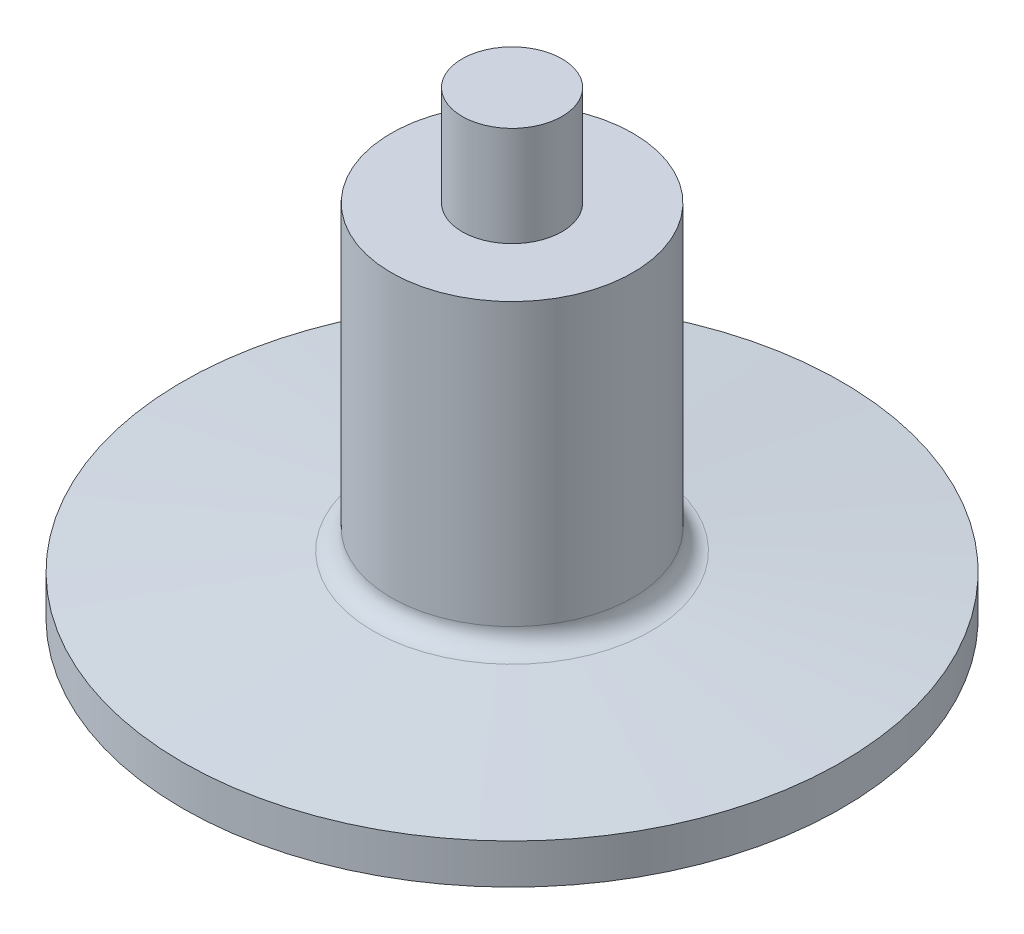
ISO-10303-21;
HEADER;
FILE_DESCRIPTION(('STEP AP214'),'2;1');
FILE_NAME('part.step','',(''),(''),'','','');
FILE_SCHEMA(('AUTOMOTIVE_DESIGN { 1 0 10303 214 1 1 1 1 }'));
ENDSEC;
DATA;
#1=APPLICATION_CONTEXT('core data for automotive mechanical design processes');
#2=APPLICATION_PROTOCOL_DEFINITION('international standard','automotive_design',2000,#1);
#3=PRODUCT_CONTEXT('',#1,'mechanical');
#4=PRODUCT('Part','Part','',(#3));
#5=PRODUCT_RELATED_PRODUCT_CATEGORY('part','',(#4));
#6=PRODUCT_DEFINITION_FORMATION('','',#4);
#7=PRODUCT_DEFINITION_CONTEXT('part definition',#1,'design');
#8=PRODUCT_DEFINITION('design','',#6,#7);
#9=PRODUCT_DEFINITION_SHAPE('','',#8);
#10=(LENGTH_UNIT() NAMED_UNIT(*) SI_UNIT(.MILLI.,.METRE.));
#11=(NAMED_UNIT(*) PLANE_ANGLE_UNIT() SI_UNIT($,.RADIAN.));
#12=(NAMED_UNIT(*) SI_UNIT($,.STERADIAN.) SOLID_ANGLE_UNIT());
#13=UNCERTAINTY_MEASURE_WITH_UNIT(LENGTH_MEASURE(1.E-05),#10,'distance_accuracy_value','');
#14=(GEOMETRIC_REPRESENTATION_CONTEXT(3) GLOBAL_UNCERTAINTY_ASSIGNED_CONTEXT((#13)) GLOBAL_UNIT_ASSIGNED_CONTEXT((#10,
#11,#12)) REPRESENTATION_CONTEXT('',''));
#15=CARTESIAN_POINT('',(0.,0.,0.));
#16=DIRECTION('',(0.,0.,1.));
#17=DIRECTION('',(1.,0.,0.));
#18=AXIS2_PLACEMENT_3D('',#15,#16,#17);
#19=CARTESIAN_POINT('',(0.,180.,0.));
#20=DIRECTION('',(0.,1.,0.));
#21=DIRECTION('',(0.,0.,1.));
#22=AXIS2_PLACEMENT_3D('',#19,#20,#21);
#23=PLANE('',#22);
#24=CARTESIAN_POINT('',(0.,180.,0.));
#25=DIRECTION('',(0.,1.,0.));
#26=DIRECTION('',(0.,0.,1.));
#27=AXIS2_PLACEMENT_3D('',#24,#25,#26);
#28=CIRCLE('',#27,60.5);
#29=CARTESIAN_POINT('',(0.,180.,60.5));
#30=VERTEX_POINT('',#29);
#31=EDGE_CURVE('E46',#30,#30,#28,.T.);
#32=ORIENTED_EDGE('',*,*,#31,.T.);
#33=EDGE_LOOP('',(#32));
#34=FACE_BOUND('',#33,.T.);
#35=CARTESIAN_POINT('',(0.,180.,0.));
#36=DIRECTION('',(0.,1.,0.));
#37=DIRECTION('',(0.,0.,1.));
#38=AXIS2_PLACEMENT_3D('',#35,#36,#37);
#39=CIRCLE('',#38,25.);
#40=CARTESIAN_POINT('',(0.,180.,25.));
#41=VERTEX_POINT('',#40);
#42=EDGE_CURVE('E52',#41,#41,#39,.T.);
#43=ORIENTED_EDGE('',*,*,#42,.F.);
#44=EDGE_LOOP('',(#43));
#45=FACE_BOUND('',#44,.T.);
#46=ADVANCED_FACE('F26',(#34,#45),#23,.T.);
#47=CARTESIAN_POINT('',(0.,20.,0.));
#48=DIRECTION('',(0.,-1.,0.));
#49=DIRECTION('',(0.,0.,-1.));
#50=AXIS2_PLACEMENT_3D('',#47,#48,#49);
#51=CYLINDRICAL_SURFACE('',#50,165.);
#52=CARTESIAN_POINT('',(0.,20.,0.));
#53=DIRECTION('',(0.,1.,0.));
#54=DIRECTION('',(0.,0.,1.));
#55=AXIS2_PLACEMENT_3D('',#52,#53,#54);
#56=CIRCLE('',#55,165.);
#57=CARTESIAN_POINT('',(0.,20.,165.));
#58=VERTEX_POINT('',#57);
#59=EDGE_CURVE('E37',#58,#58,#56,.T.);
#60=ORIENTED_EDGE('',*,*,#59,.F.);
#61=EDGE_LOOP('',(#60));
#62=FACE_BOUND('',#61,.T.);
#63=CARTESIAN_POINT('',(0.,0.,0.));
#64=DIRECTION('',(0.,1.,0.));
#65=DIRECTION('',(0.,0.,1.));
#66=AXIS2_PLACEMENT_3D('',#63,#64,#65);
#67=CIRCLE('',#66,165.);
#68=CARTESIAN_POINT('',(0.,0.,165.));
#69=VERTEX_POINT('',#68);
#70=EDGE_CURVE('E41',#69,#69,#67,.T.);
#71=ORIENTED_EDGE('',*,*,#70,.T.);
#72=EDGE_LOOP('',(#71));
#73=FACE_BOUND('',#72,.T.);
#74=ADVANCED_FACE('F28',(#62,#73),#51,.T.);
#75=CARTESIAN_POINT('',(0.,0.,0.));
#76=DIRECTION('',(0.,1.,0.));
#77=DIRECTION('',(0.,0.,1.));
#78=AXIS2_PLACEMENT_3D('',#75,#76,#77);
#79=PLANE('',#78);
#80=ORIENTED_EDGE('',*,*,#70,.F.);
#81=EDGE_LOOP('',(#80));
#82=FACE_BOUND('',#81,.T.);
#83=ADVANCED_FACE('F66',(#82),#79,.F.);
#84=CARTESIAN_POINT('',(0.,30.,0.));
#85=DIRECTION('',(0.,-1.,0.));
#86=DIRECTION('',(0.,0.,-1.));
#87=AXIS2_PLACEMENT_3D('',#84,#85,#86);
#88=CONICAL_SURFACE('',#87,60.5,1.47539305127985);
#89=CARTESIAN_POINT('',(0.,29.134218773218,0.));
#90=DIRECTION('',(0.,1.,0.));
#91=DIRECTION('',(0.,0.,1.));
#92=AXIS2_PLACEMENT_3D('',#89,#90,#91);
#93=CIRCLE('',#92,69.5474138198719);
#94=CARTESIAN_POINT('',(0.,29.134218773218,69.5474138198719));
#95=VERTEX_POINT('',#94);
#96=EDGE_CURVE('E10',#95,#95,#93,.F.);
#97=ORIENTED_EDGE('',*,*,#96,.T.);
#98=EDGE_LOOP('',(#97));
#99=FACE_BOUND('',#98,.T.);
#100=ORIENTED_EDGE('',*,*,#59,.T.);
#101=EDGE_LOOP('',(#100));
#102=FACE_BOUND('',#101,.T.);
#103=ADVANCED_FACE('F75',(#99,#102),#88,.T.);
#104=CARTESIAN_POINT('',(0.,180.,0.));
#105=DIRECTION('',(0.,-1.,0.));
#106=DIRECTION('',(0.,0.,-1.));
#107=AXIS2_PLACEMENT_3D('',#104,#105,#106);
#108=CYLINDRICAL_SURFACE('',#107,60.5);
#109=CARTESIAN_POINT('',(0.,39.0887443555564,0.));
#110=DIRECTION('',(0.,1.,0.));
#111=DIRECTION('',(0.,0.,1.));
#112=AXIS2_PLACEMENT_3D('',#109,#110,#111);
#113=CIRCLE('',#112,60.5);
#114=CARTESIAN_POINT('',(0.,39.0887443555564,60.5));
#115=VERTEX_POINT('',#114);
#116=EDGE_CURVE('E33',#115,#115,#113,.T.);
#117=ORIENTED_EDGE('',*,*,#116,.T.);
#118=EDGE_LOOP('',(#117));
#119=FACE_BOUND('',#118,.T.);
#120=ORIENTED_EDGE('',*,*,#31,.F.);
#121=EDGE_LOOP('',(#120));
#122=FACE_BOUND('',#121,.T.);
#123=ADVANCED_FACE('F72',(#119,#122),#108,.T.);
#124=CARTESIAN_POINT('',(0.,39.0887443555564,0.));
#125=DIRECTION('',(0.,1.,0.));
#126=DIRECTION('',(0.,0.,1.));
#127=AXIS2_PLACEMENT_3D('',#124,#125,#126);
#128=TOROIDAL_SURFACE('',#127,70.5,10.);
#129=ORIENTED_EDGE('',*,*,#96,.F.);
#130=EDGE_LOOP('',(#129));
#131=FACE_BOUND('',#130,.T.);
#132=ORIENTED_EDGE('',*,*,#116,.F.);
#133=EDGE_LOOP('',(#132));
#134=FACE_BOUND('',#133,.T.);
#135=ADVANCED_FACE('F70',(#131,#134),#128,.F.);
#136=CARTESIAN_POINT('',(0.,230.,0.));
#137=DIRECTION('',(0.,-1.,0.));
#138=DIRECTION('',(0.,0.,-1.));
#139=AXIS2_PLACEMENT_3D('',#136,#137,#138);
#140=CYLINDRICAL_SURFACE('',#139,25.);
#141=CARTESIAN_POINT('',(0.,230.,0.));
#142=DIRECTION('',(0.,1.,0.));
#143=DIRECTION('',(0.,0.,1.));
#144=AXIS2_PLACEMENT_3D('',#141,#142,#143);
#145=CIRCLE('',#144,25.);
#146=CARTESIAN_POINT('',(0.,230.,25.));
#147=VERTEX_POINT('',#146);
#148=EDGE_CURVE('E49',#147,#147,#145,.T.);
#149=ORIENTED_EDGE('',*,*,#148,.F.);
#150=EDGE_LOOP('',(#149));
#151=FACE_BOUND('',#150,.T.);
#152=ORIENTED_EDGE('',*,*,#42,.T.);
#153=EDGE_LOOP('',(#152));
#154=FACE_BOUND('',#153,.T.);
#155=ADVANCED_FACE('F56',(#151,#154),#140,.T.);
#156=CARTESIAN_POINT('',(0.,230.,0.));
#157=DIRECTION('',(0.,1.,0.));
#158=DIRECTION('',(0.,0.,1.));
#159=AXIS2_PLACEMENT_3D('',#156,#157,#158);
#160=PLANE('',#159);
#161=ORIENTED_EDGE('',*,*,#148,.T.);
#162=EDGE_LOOP('',(#161));
#163=FACE_BOUND('',#162,.T.);
#164=ADVANCED_FACE('F106',(#163),#160,.T.);
#165=CLOSED_SHELL('',(#46,#74,#83,#103,#123,#135,#155,#164));
#166=MANIFOLD_SOLID_BREP('B2',#165);
#167=ADVANCED_BREP_SHAPE_REPRESENTATION('',(#18,#166),#14);
#168=SHAPE_DEFINITION_REPRESENTATION(#9,#167);
ENDSEC;
END-ISO-10303-21;
